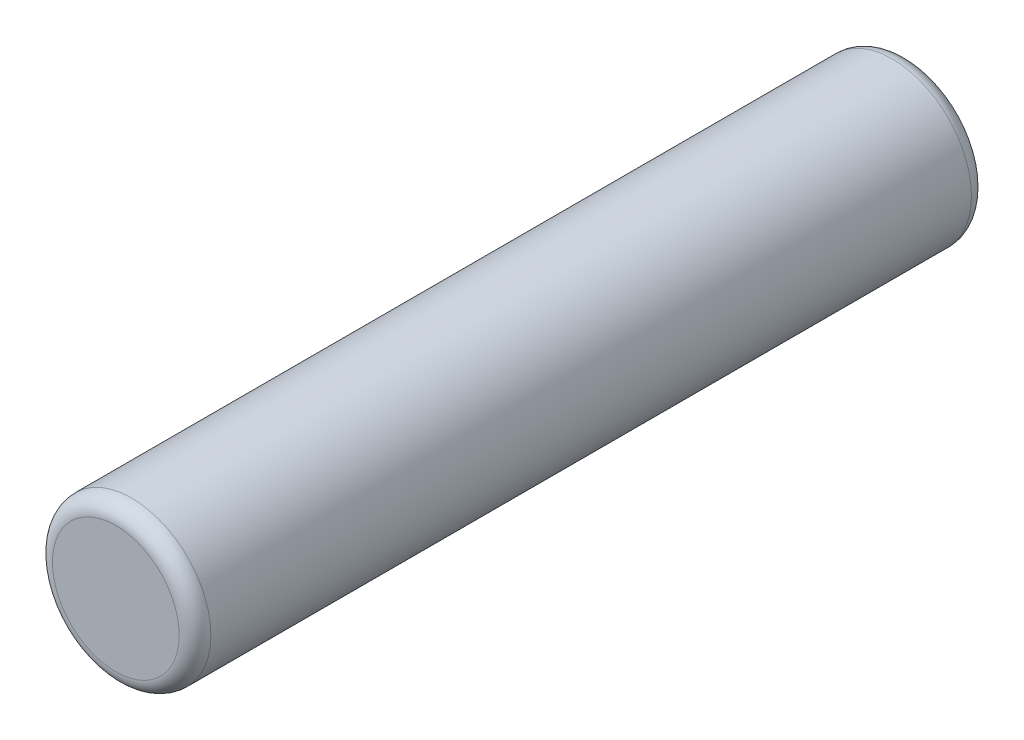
from build123d import *

# Parameters (mm, degrees)
ESQUISSE1_R      = 10
EXTRUSION1_DEPTH = 100
CONG_3_R         = 2


with BuildPart() as part:
    # Esquisse1 → Extrusion1 (new body)
    with BuildSketch(Plane.XY):
        Circle(ESQUISSE1_R)
    extrude(amount=EXTRUSION1_DEPTH)

    # Cong_3
    cong_3_edges = [part.edges().sort_by_distance(p)[0] for p in [
        (-10, 0, 0),
        (-10, 0, 100),
    ]]
    fillet(cong_3_edges, radius=CONG_3_R)


solid = part.part
